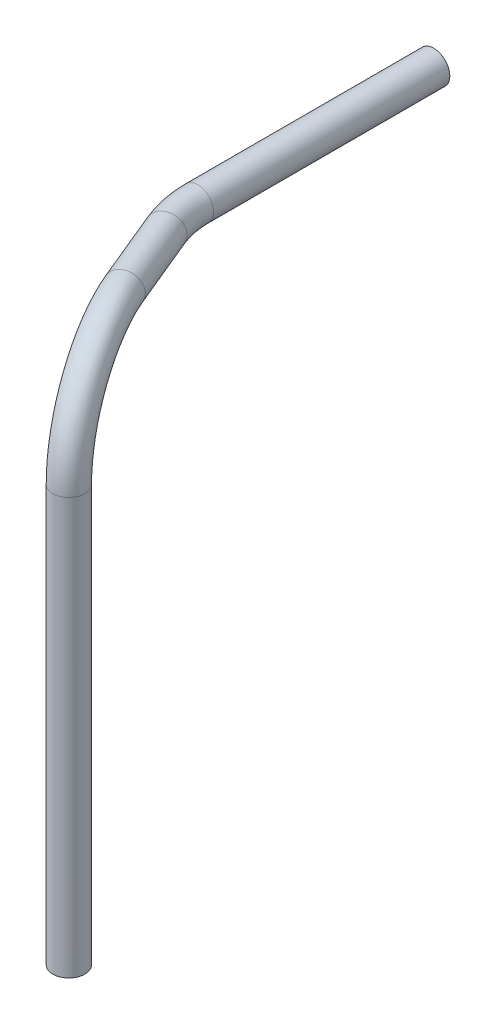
from build123d import *

# Parameters (mm, degrees)
SKETCH1_R   = 7.9375
SKETCH1_R_2 = 4.86156


with BuildPart() as part:
    # Sweep1: sweep along a curve in space
    with BuildLine() as sweep1_path:
        Line((37.950577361, -50.8, 218.620798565), (37.950577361, -256.85170068, 218.620798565))
        ThreePointArc((18.510258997, 0, 171.687718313), (32.256639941, -14.878975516, 204.874417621), (37.950577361, -50.8, 218.620798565))
        Line((3.866919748, 0, 136.335570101), (18.510258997, 0, 171.687718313))
        ThreePointArc((0, 0, 116.895251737), (0.976107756, 0, 126.805840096), (3.866919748, 0, 136.335570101))
        Line((0, 0, 116.895251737), (0, 0, 0))
    # Sketch1 → Sweep1 (sweep)
    with BuildSketch(Plane.XY):
        Circle(SKETCH1_R)
        Circle(SKETCH1_R_2, mode=Mode.SUBTRACT)
    sweep(path=sweep1_path.line)


solid = part.part
